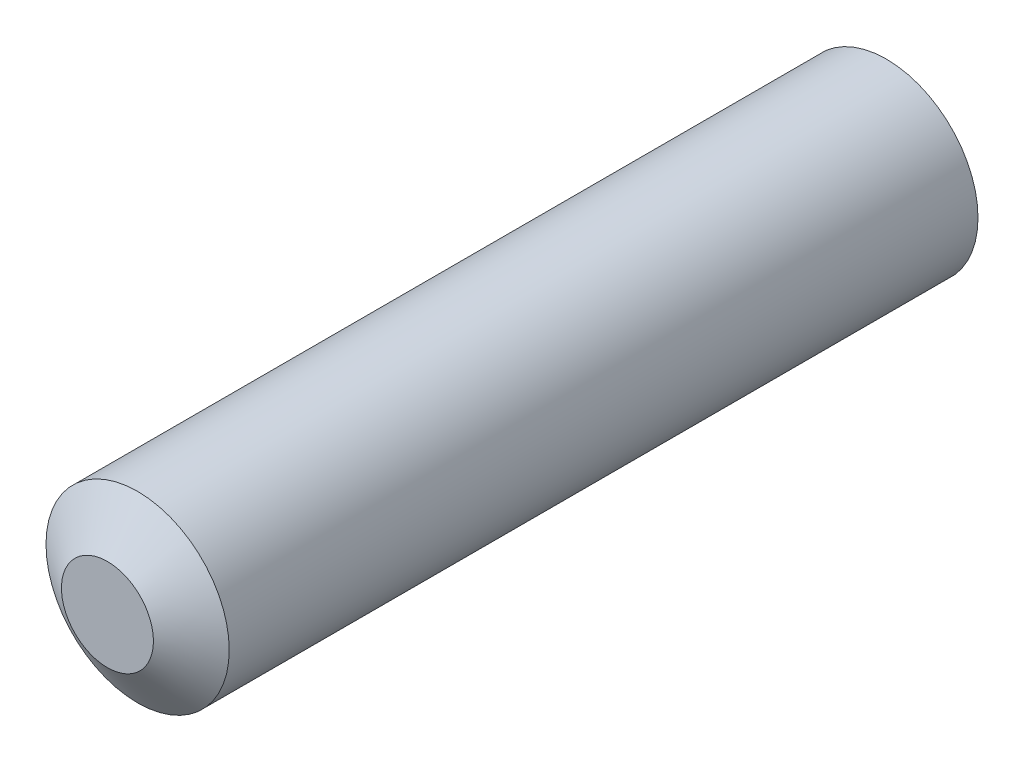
from build123d import *

# Parameters (mm, degrees)
SKETCH1_R           = 1.275
BOSS_EXTRUDE1_DEPTH = 11.26
CHAMFER1_SIZE       = 0.42
CHAMFER1_SIZE2      = 0.635
CHAMFER2_SIZE       = 0.635
CHAMFER2_SIZE2      = 0.42


with BuildPart() as part:
    # Sketch1 → Boss-Extrude1 (new body)
    with BuildSketch(Plane.XY):
        Circle(SKETCH1_R)
    extrude(amount=-BOSS_EXTRUDE1_DEPTH)

    # Chamfer1
    chamfer1_edges = [part.edges().sort_by_distance(p)[0] for p in [
        (-1.275, 0, 0),
    ]]
    chamfer1_side = [part.faces().sort_by_distance(p)[0] for p in [
        (-1.275, 0, -5.63),
    ]]
    chamfer(chamfer1_edges, length=CHAMFER1_SIZE, length2=CHAMFER1_SIZE2, reference=chamfer1_side[0])

    # Chamfer2
    chamfer2_edges = [part.edges().sort_by_distance(p)[0] for p in [
        (-1.275, 0, -11.26),
    ]]
    chamfer2_side = [part.faces().sort_by_distance(p)[0] for p in [
        (0, 0, -11.26),
    ]]
    chamfer(chamfer2_edges, length=CHAMFER2_SIZE, length2=CHAMFER2_SIZE2, reference=chamfer2_side[0])


solid = part.part
